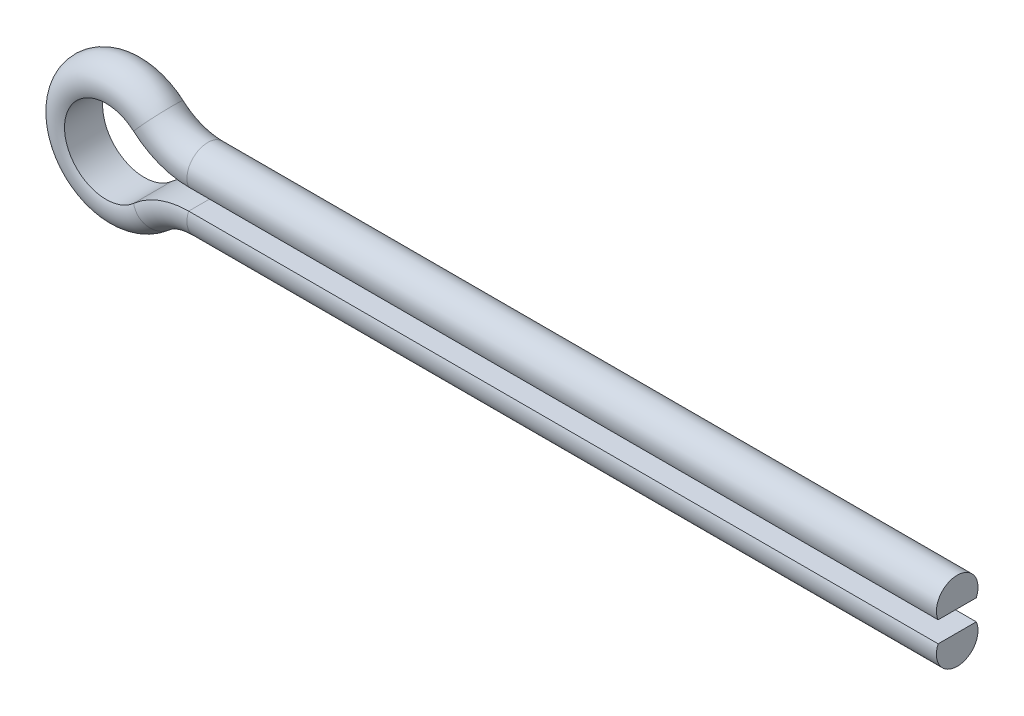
from build123d import *


with BuildPart() as part:
    # Sweep1: sweep along a path in Sketch1
    with BuildLine(Plane.XY) as sweep1_path:
        Line((100, 1.25), (9.921567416, 1.25))
        ThreePointArc((9.921567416, 1.25), (6.386033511, 1.895856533), (3.307189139, 3.75))
        ThreePointArc((3.307189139, 3.75), (-5, 0), (3.307189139, -3.75))
        ThreePointArc((3.307189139, -3.75), (6.386033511, -1.895856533), (9.921567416, -1.25))
        Line((9.921567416, -1.25), (100, -1.25))
    # Sketch2 → Sweep1 (sweep)
    with BuildSketch(Plane(origin=(100, 1.25, 0), x_dir=(0, 0, 1), z_dir=(-1, 0, 0))):
        with BuildLine():
            Line((2.291287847, 0), (-2.291287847, 0))
            ThreePointArc((-2.291287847, 0), (0, 3.5), (2.291287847, 0))
        make_face()
    sweep(path=sweep1_path.line)


solid = part.part
